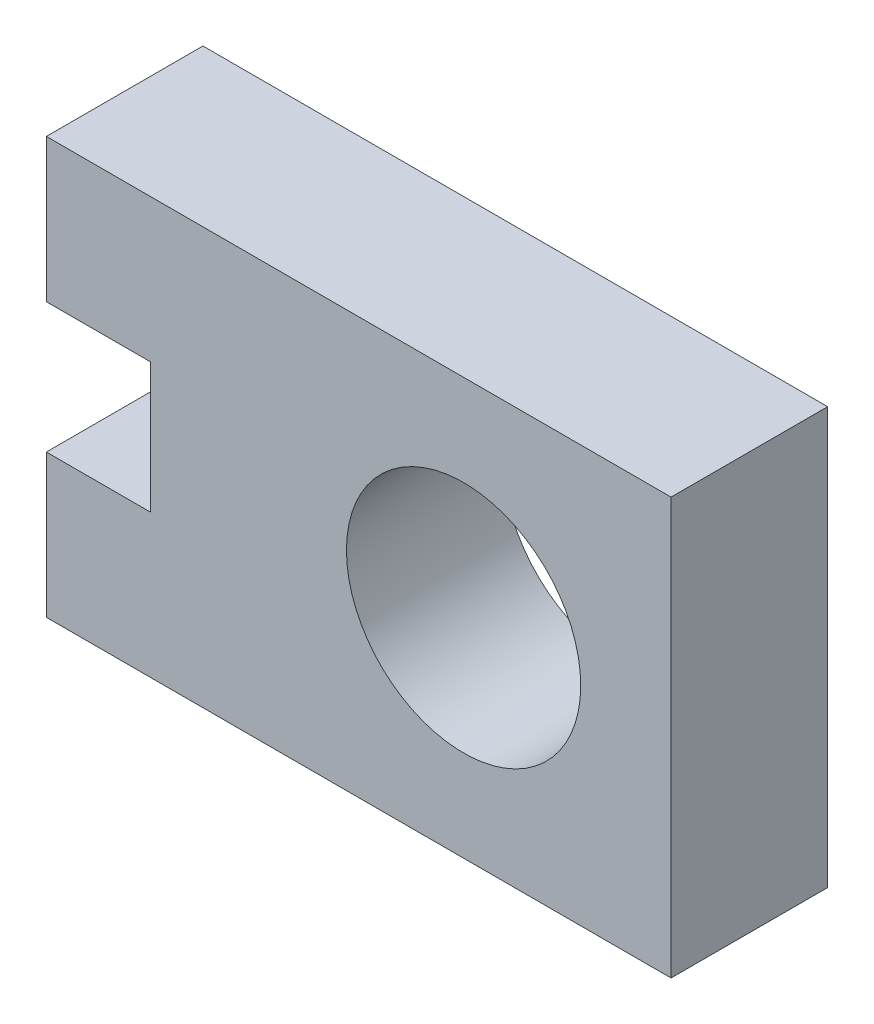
from build123d import *

# Parameters (mm, degrees)
BASE_EXTRUDE_DEPTH      = 4.7752
BASE_EXTRUDE_DEPTH_BACK = 4.7752
SKETCH1_R               = 7.14375


with BuildPart() as part:
    # Sketch1 → Base-Extrude (new, two sides: drawn at the far end of the back side and taken through both)
    with BuildSketch(Plane.XY.offset(-BASE_EXTRUDE_DEPTH_BACK)):
        Polygon((19.05, 12.7), (-19.05, 12.7), (-19.05, 3.96875), (-12.7, 3.96875), (-12.7, -3.96875), (-19.05, -3.96875), (-19.05, -12.7), (19.05, -12.7), align=None)
        with Locations((6.396772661, 0)):
            Circle(SKETCH1_R, mode=Mode.SUBTRACT)
    extrude(amount=BASE_EXTRUDE_DEPTH + BASE_EXTRUDE_DEPTH_BACK)


solid = part.part
